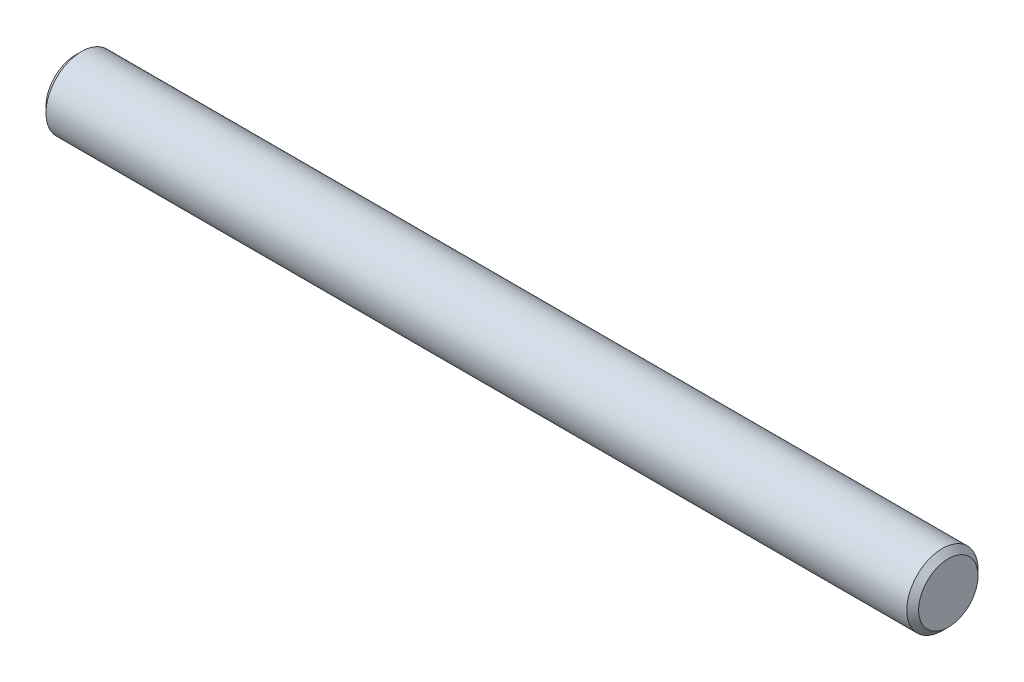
ISO-10303-21;
HEADER;
FILE_DESCRIPTION(('STEP AP214'),'2;1');
FILE_NAME('part.step','',(''),(''),'','','');
FILE_SCHEMA(('AUTOMOTIVE_DESIGN { 1 0 10303 214 1 1 1 1 }'));
ENDSEC;
DATA;
#1=APPLICATION_CONTEXT('core data for automotive mechanical design processes');
#2=APPLICATION_PROTOCOL_DEFINITION('international standard','automotive_design',2000,#1);
#3=PRODUCT_CONTEXT('',#1,'mechanical');
#4=PRODUCT('Part','Part','',(#3));
#5=PRODUCT_RELATED_PRODUCT_CATEGORY('part','',(#4));
#6=PRODUCT_DEFINITION_FORMATION('','',#4);
#7=PRODUCT_DEFINITION_CONTEXT('part definition',#1,'design');
#8=PRODUCT_DEFINITION('design','',#6,#7);
#9=PRODUCT_DEFINITION_SHAPE('','',#8);
#10=(LENGTH_UNIT() NAMED_UNIT(*) SI_UNIT(.MILLI.,.METRE.));
#11=(NAMED_UNIT(*) PLANE_ANGLE_UNIT() SI_UNIT($,.RADIAN.));
#12=(NAMED_UNIT(*) SI_UNIT($,.STERADIAN.) SOLID_ANGLE_UNIT());
#13=UNCERTAINTY_MEASURE_WITH_UNIT(LENGTH_MEASURE(1.E-05),#10,'distance_accuracy_value','');
#14=(GEOMETRIC_REPRESENTATION_CONTEXT(3) GLOBAL_UNCERTAINTY_ASSIGNED_CONTEXT((#13)) GLOBAL_UNIT_ASSIGNED_CONTEXT((#10,
#11,#12)) REPRESENTATION_CONTEXT('',''));
#15=CARTESIAN_POINT('',(0.,0.,0.));
#16=DIRECTION('',(0.,0.,1.));
#17=DIRECTION('',(1.,0.,0.));
#18=AXIS2_PLACEMENT_3D('',#15,#16,#17);
#19=CARTESIAN_POINT('',(147.,0.,0.));
#20=DIRECTION('',(-1.,0.,0.));
#21=DIRECTION('',(0.,0.,1.));
#22=AXIS2_PLACEMENT_3D('',#19,#20,#21);
#23=CYLINDRICAL_SURFACE('',#22,6.);
#24=CARTESIAN_POINT('',(146.,0.,0.));
#25=DIRECTION('',(1.,0.,0.));
#26=DIRECTION('',(0.,0.,-1.));
#27=AXIS2_PLACEMENT_3D('',#24,#25,#26);
#28=CIRCLE('',#27,6.);
#29=CARTESIAN_POINT('',(146.,0.,-6.));
#30=VERTEX_POINT('',#29);
#31=EDGE_CURVE('E353',#30,#30,#28,.F.);
#32=ORIENTED_EDGE('',*,*,#31,.T.);
#33=EDGE_LOOP('',(#32));
#34=FACE_BOUND('',#33,.T.);
#35=CARTESIAN_POINT('',(1.,0.,0.));
#36=DIRECTION('',(1.,0.,0.));
#37=DIRECTION('',(0.,0.,-1.));
#38=AXIS2_PLACEMENT_3D('',#35,#36,#37);
#39=CIRCLE('',#38,6.);
#40=CARTESIAN_POINT('',(1.,0.,-6.));
#41=VERTEX_POINT('',#40);
#42=EDGE_CURVE('E357',#41,#41,#39,.T.);
#43=ORIENTED_EDGE('',*,*,#42,.T.);
#44=EDGE_LOOP('',(#43));
#45=FACE_BOUND('',#44,.T.);
#46=ADVANCED_FACE('F347',(#34,#45),#23,.T.);
#47=CARTESIAN_POINT('',(147.,0.,0.));
#48=DIRECTION('',(1.,0.,0.));
#49=DIRECTION('',(0.,0.,-1.));
#50=AXIS2_PLACEMENT_3D('',#47,#48,#49);
#51=PLANE('',#50);
#52=CARTESIAN_POINT('',(147.,0.,0.));
#53=DIRECTION('',(1.,0.,0.));
#54=DIRECTION('',(0.,0.,-1.));
#55=AXIS2_PLACEMENT_3D('',#52,#53,#54);
#56=CIRCLE('',#55,5.);
#57=CARTESIAN_POINT('',(147.,0.,-5.));
#58=VERTEX_POINT('',#57);
#59=EDGE_CURVE('E361',#58,#58,#56,.T.);
#60=ORIENTED_EDGE('',*,*,#59,.T.);
#61=EDGE_LOOP('',(#60));
#62=FACE_BOUND('',#61,.T.);
#63=ADVANCED_FACE('F367',(#62),#51,.T.);
#64=CARTESIAN_POINT('',(0.,0.,0.));
#65=DIRECTION('',(1.,0.,0.));
#66=DIRECTION('',(0.,0.,-1.));
#67=AXIS2_PLACEMENT_3D('',#64,#65,#66);
#68=PLANE('',#67);
#69=CARTESIAN_POINT('',(0.,0.,0.));
#70=DIRECTION('',(1.,0.,0.));
#71=DIRECTION('',(0.,0.,-1.));
#72=AXIS2_PLACEMENT_3D('',#69,#70,#71);
#73=CIRCLE('',#72,4.99999999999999);
#74=CARTESIAN_POINT('',(0.,0.,-4.99999999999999));
#75=VERTEX_POINT('',#74);
#76=EDGE_CURVE('E10',#75,#75,#73,.F.);
#77=ORIENTED_EDGE('',*,*,#76,.T.);
#78=EDGE_LOOP('',(#77));
#79=FACE_BOUND('',#78,.T.);
#80=ADVANCED_FACE('F372',(#79),#68,.F.);
#81=CARTESIAN_POINT('',(147.,0.,0.));
#82=DIRECTION('',(-1.,0.,0.));
#83=DIRECTION('',(0.,0.,1.));
#84=AXIS2_PLACEMENT_3D('',#81,#82,#83);
#85=CONICAL_SURFACE('',#84,5.,0.785398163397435);
#86=ORIENTED_EDGE('',*,*,#31,.F.);
#87=EDGE_LOOP('',(#86));
#88=FACE_BOUND('',#87,.T.);
#89=ORIENTED_EDGE('',*,*,#59,.F.);
#90=EDGE_LOOP('',(#89));
#91=FACE_BOUND('',#90,.T.);
#92=ADVANCED_FACE('F369',(#88,#91),#85,.T.);
#93=CARTESIAN_POINT('',(1.,0.,0.));
#94=DIRECTION('',(1.,0.,0.));
#95=DIRECTION('',(0.,0.,-1.));
#96=AXIS2_PLACEMENT_3D('',#93,#94,#95);
#97=CONICAL_SURFACE('',#96,6.,0.785398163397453);
#98=ORIENTED_EDGE('',*,*,#76,.F.);
#99=EDGE_LOOP('',(#98));
#100=FACE_BOUND('',#99,.T.);
#101=ORIENTED_EDGE('',*,*,#42,.F.);
#102=EDGE_LOOP('',(#101));
#103=FACE_BOUND('',#102,.T.);
#104=ADVANCED_FACE('F371',(#100,#103),#97,.T.);
#105=CLOSED_SHELL('',(#46,#63,#80,#92,#104));
#106=MANIFOLD_SOLID_BREP('B2',#105);
#107=ADVANCED_BREP_SHAPE_REPRESENTATION('',(#18,#106),#14);
#108=SHAPE_DEFINITION_REPRESENTATION(#9,#107);
ENDSEC;
END-ISO-10303-21;
